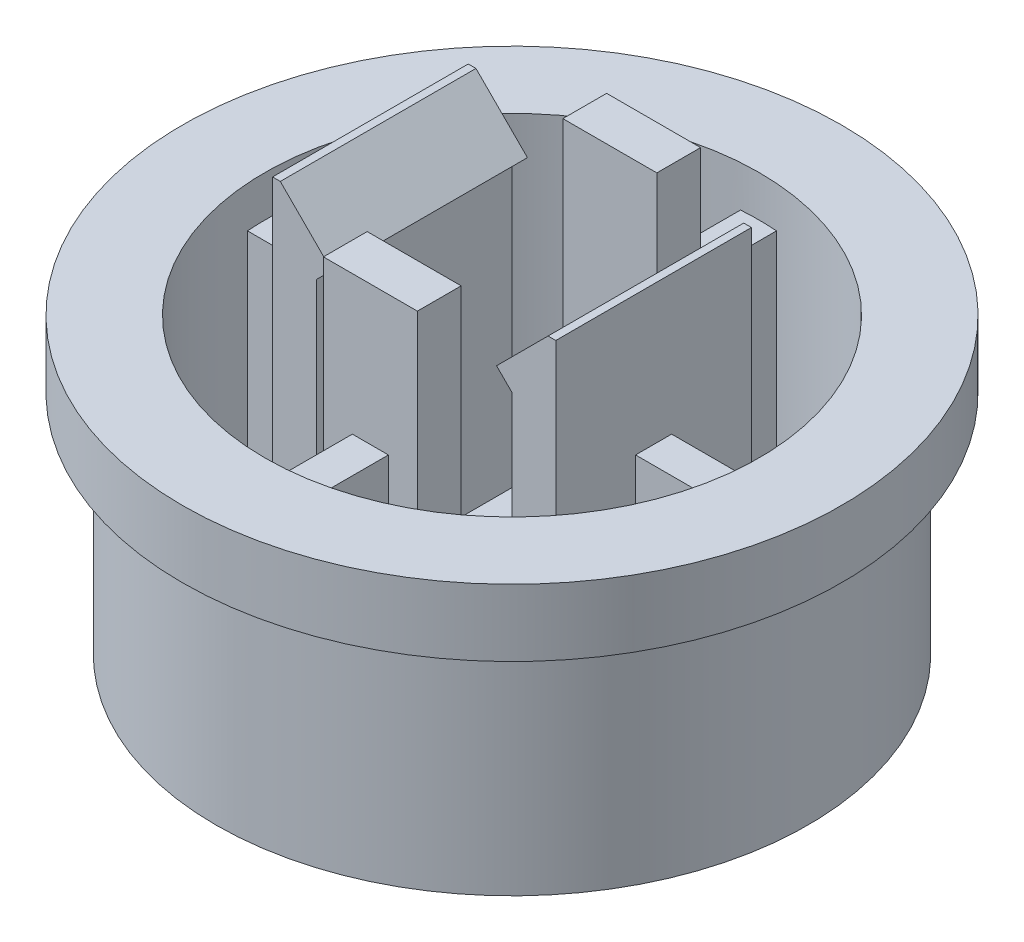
ISO-10303-21;
HEADER;
FILE_DESCRIPTION(('STEP AP214'),'2;1');
FILE_NAME('part.step','',(''),(''),'','','');
FILE_SCHEMA(('AUTOMOTIVE_DESIGN { 1 0 10303 214 1 1 1 1 }'));
ENDSEC;
DATA;
#1=APPLICATION_CONTEXT('core data for automotive mechanical design processes');
#2=APPLICATION_PROTOCOL_DEFINITION('international standard','automotive_design',2000,#1);
#3=PRODUCT_CONTEXT('',#1,'mechanical');
#4=PRODUCT('Part','Part','',(#3));
#5=PRODUCT_RELATED_PRODUCT_CATEGORY('part','',(#4));
#6=PRODUCT_DEFINITION_FORMATION('','',#4);
#7=PRODUCT_DEFINITION_CONTEXT('part definition',#1,'design');
#8=PRODUCT_DEFINITION('design','',#6,#7);
#9=PRODUCT_DEFINITION_SHAPE('','',#8);
#10=(LENGTH_UNIT() NAMED_UNIT(*) SI_UNIT(.MILLI.,.METRE.));
#11=(NAMED_UNIT(*) PLANE_ANGLE_UNIT() SI_UNIT($,.RADIAN.));
#12=(NAMED_UNIT(*) SI_UNIT($,.STERADIAN.) SOLID_ANGLE_UNIT());
#13=UNCERTAINTY_MEASURE_WITH_UNIT(LENGTH_MEASURE(1.E-05),#10,'distance_accuracy_value','');
#14=(GEOMETRIC_REPRESENTATION_CONTEXT(3) GLOBAL_UNCERTAINTY_ASSIGNED_CONTEXT((#13)) GLOBAL_UNIT_ASSIGNED_CONTEXT((#10,
#11,#12)) REPRESENTATION_CONTEXT('',''));
#15=CARTESIAN_POINT('',(0.,0.,0.));
#16=DIRECTION('',(0.,0.,1.));
#17=DIRECTION('',(1.,0.,0.));
#18=AXIS2_PLACEMENT_3D('',#15,#16,#17);
#19=CARTESIAN_POINT('',(0.,0.9,0.));
#20=DIRECTION('',(0.,1.,0.));
#21=DIRECTION('',(0.,0.,1.));
#22=AXIS2_PLACEMENT_3D('',#19,#20,#21);
#23=PLANE('',#22);
#24=DIRECTION('',(1.,0.,0.));
#25=VECTOR('',#24,1.);
#26=CARTESIAN_POINT('',(-0.912441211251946,0.9,2.75));
#27=LINE('',#26,#25);
#28=CARTESIAN_POINT('',(0.35,0.9,2.75));
#29=VERTEX_POINT('',#28);
#30=CARTESIAN_POINT('',(0.912441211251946,0.9,2.75));
#31=VERTEX_POINT('',#30);
#32=EDGE_CURVE('E477',#29,#31,#27,.T.);
#33=ORIENTED_EDGE('',*,*,#32,.F.);
#34=DIRECTION('',(0.,0.,-1.));
#35=VECTOR('',#34,1.);
#36=CARTESIAN_POINT('',(0.35,0.9,4.78722257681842));
#37=LINE('',#36,#35);
#38=CARTESIAN_POINT('',(0.35,0.9,4.78722257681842));
#39=VERTEX_POINT('',#38);
#40=EDGE_CURVE('E669',#39,#29,#37,.T.);
#41=ORIENTED_EDGE('',*,*,#40,.F.);
#42=CARTESIAN_POINT('',(0.,0.900000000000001,0.));
#43=DIRECTION('',(0.,1.,0.));
#44=DIRECTION('',(0.,0.,1.));
#45=AXIS2_PLACEMENT_3D('',#42,#43,#44);
#46=CIRCLE('',#45,4.8);
#47=CARTESIAN_POINT('',(4.78722257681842,0.9,0.349999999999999));
#48=VERTEX_POINT('',#47);
#49=EDGE_CURVE('E295',#48,#39,#46,.F.);
#50=ORIENTED_EDGE('',*,*,#49,.F.);
#51=DIRECTION('',(1.,0.,0.));
#52=VECTOR('',#51,1.);
#53=CARTESIAN_POINT('',(4.78722257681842,0.9,0.349999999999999));
#54=LINE('',#53,#52);
#55=CARTESIAN_POINT('',(2.75,0.9,0.35));
#56=VERTEX_POINT('',#55);
#57=EDGE_CURVE('E301',#56,#48,#54,.T.);
#58=ORIENTED_EDGE('',*,*,#57,.F.);
#59=DIRECTION('',(0.,0.,-1.));
#60=VECTOR('',#59,1.);
#61=CARTESIAN_POINT('',(2.75,0.9,1.9));
#62=LINE('',#61,#60);
#63=CARTESIAN_POINT('',(2.75,0.9,1.9));
#64=VERTEX_POINT('',#63);
#65=EDGE_CURVE('E583',#64,#56,#62,.T.);
#66=ORIENTED_EDGE('',*,*,#65,.F.);
#67=DIRECTION('',(1.,0.,0.));
#68=VECTOR('',#67,1.);
#69=CARTESIAN_POINT('',(1.9,0.9,1.9));
#70=LINE('',#69,#68);
#71=CARTESIAN_POINT('',(1.9,0.9,1.9));
#72=VERTEX_POINT('',#71);
#73=EDGE_CURVE('E597',#72,#64,#70,.T.);
#74=ORIENTED_EDGE('',*,*,#73,.F.);
#75=DIRECTION('',(0.,0.,1.));
#76=VECTOR('',#75,1.);
#77=CARTESIAN_POINT('',(1.9,0.9,1.9));
#78=LINE('',#77,#76);
#79=CARTESIAN_POINT('',(1.9,0.9,-1.9));
#80=VERTEX_POINT('',#79);
#81=EDGE_CURVE('E593',#80,#72,#78,.T.);
#82=ORIENTED_EDGE('',*,*,#81,.F.);
#83=DIRECTION('',(-1.,0.,0.));
#84=VECTOR('',#83,1.);
#85=CARTESIAN_POINT('',(1.9,0.9,-1.9));
#86=LINE('',#85,#84);
#87=CARTESIAN_POINT('',(2.75,0.9,-1.9));
#88=VERTEX_POINT('',#87);
#89=EDGE_CURVE('E577',#88,#80,#86,.T.);
#90=ORIENTED_EDGE('',*,*,#89,.F.);
#91=CARTESIAN_POINT('',(2.75,0.9,-0.35));
#92=VERTEX_POINT('',#91);
#93=EDGE_CURVE('E601',#92,#88,#62,.T.);
#94=ORIENTED_EDGE('',*,*,#93,.F.);
#95=DIRECTION('',(-1.,0.,0.));
#96=VECTOR('',#95,1.);
#97=CARTESIAN_POINT('',(4.78722257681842,0.9,-0.350000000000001));
#98=LINE('',#97,#96);
#99=CARTESIAN_POINT('',(4.78722257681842,0.9,-0.350000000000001));
#100=VERTEX_POINT('',#99);
#101=EDGE_CURVE('E297',#100,#92,#98,.T.);
#102=ORIENTED_EDGE('',*,*,#101,.F.);
#103=CARTESIAN_POINT('',(0.35,0.9,-4.78722257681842));
#104=VERTEX_POINT('',#103);
#105=EDGE_CURVE('E46',#104,#100,#46,.F.);
#106=ORIENTED_EDGE('',*,*,#105,.F.);
#107=DIRECTION('',(0.,0.,-1.));
#108=VECTOR('',#107,1.);
#109=CARTESIAN_POINT('',(0.35,0.9,-2.75));
#110=LINE('',#109,#108);
#111=CARTESIAN_POINT('',(0.35,0.9,-2.75));
#112=VERTEX_POINT('',#111);
#113=EDGE_CURVE('E340',#112,#104,#110,.T.);
#114=ORIENTED_EDGE('',*,*,#113,.F.);
#115=DIRECTION('',(-1.,0.,0.));
#116=VECTOR('',#115,1.);
#117=CARTESIAN_POINT('',(-0.912441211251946,0.9,-2.75));
#118=LINE('',#117,#116);
#119=CARTESIAN_POINT('',(0.912441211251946,0.9,-2.75));
#120=VERTEX_POINT('',#119);
#121=EDGE_CURVE('E514',#120,#112,#118,.T.);
#122=ORIENTED_EDGE('',*,*,#121,.F.);
#123=DIRECTION('',(0.,0.,-1.));
#124=VECTOR('',#123,1.);
#125=CARTESIAN_POINT('',(0.912441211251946,0.9,-1.9));
#126=LINE('',#125,#124);
#127=CARTESIAN_POINT('',(0.912441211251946,0.9,-1.9));
#128=VERTEX_POINT('',#127);
#129=EDGE_CURVE('E494',#128,#120,#126,.T.);
#130=ORIENTED_EDGE('',*,*,#129,.F.);
#131=DIRECTION('',(1.,0.,0.));
#132=VECTOR('',#131,1.);
#133=CARTESIAN_POINT('',(-0.912441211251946,0.9,-1.9));
#134=LINE('',#133,#132);
#135=CARTESIAN_POINT('',(-0.912441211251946,0.9,-1.9));
#136=VERTEX_POINT('',#135);
#137=EDGE_CURVE('E500',#136,#128,#134,.T.);
#138=ORIENTED_EDGE('',*,*,#137,.F.);
#139=DIRECTION('',(0.,0.,1.));
#140=VECTOR('',#139,1.);
#141=CARTESIAN_POINT('',(-0.912441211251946,0.9,-1.9));
#142=LINE('',#141,#140);
#143=CARTESIAN_POINT('',(-0.912441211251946,0.9,-2.75));
#144=VERTEX_POINT('',#143);
#145=EDGE_CURVE('E518',#144,#136,#142,.T.);
#146=ORIENTED_EDGE('',*,*,#145,.F.);
#147=CARTESIAN_POINT('',(-0.35,0.9,-2.75));
#148=VERTEX_POINT('',#147);
#149=EDGE_CURVE('E513',#148,#144,#118,.T.);
#150=ORIENTED_EDGE('',*,*,#149,.F.);
#151=DIRECTION('',(0.,0.,1.));
#152=VECTOR('',#151,1.);
#153=CARTESIAN_POINT('',(-0.35,0.9,-2.75));
#154=LINE('',#153,#152);
#155=CARTESIAN_POINT('',(-0.35,0.9,-4.78722257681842));
#156=VERTEX_POINT('',#155);
#157=EDGE_CURVE('E334',#156,#148,#154,.T.);
#158=ORIENTED_EDGE('',*,*,#157,.F.);
#159=CARTESIAN_POINT('',(-4.78722257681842,0.9,-0.35));
#160=VERTEX_POINT('',#159);
#161=EDGE_CURVE('E11',#160,#156,#46,.F.);
#162=ORIENTED_EDGE('',*,*,#161,.F.);
#163=DIRECTION('',(-1.,0.,0.));
#164=VECTOR('',#163,1.);
#165=CARTESIAN_POINT('',(-2.75,0.9,-0.35));
#166=LINE('',#165,#164);
#167=CARTESIAN_POINT('',(-2.75,0.9,-0.35));
#168=VERTEX_POINT('',#167);
#169=EDGE_CURVE('E374',#168,#160,#166,.T.);
#170=ORIENTED_EDGE('',*,*,#169,.F.);
#171=DIRECTION('',(0.,0.,1.));
#172=VECTOR('',#171,1.);
#173=CARTESIAN_POINT('',(-2.75,0.9,1.9));
#174=LINE('',#173,#172);
#175=CARTESIAN_POINT('',(-2.75,0.9,-1.9));
#176=VERTEX_POINT('',#175);
#177=EDGE_CURVE('E543',#176,#168,#174,.T.);
#178=ORIENTED_EDGE('',*,*,#177,.F.);
#179=DIRECTION('',(-1.,0.,0.));
#180=VECTOR('',#179,1.);
#181=CARTESIAN_POINT('',(-1.9,0.9,-1.9));
#182=LINE('',#181,#180);
#183=CARTESIAN_POINT('',(-1.9,0.9,-1.9));
#184=VERTEX_POINT('',#183);
#185=EDGE_CURVE('E557',#184,#176,#182,.T.);
#186=ORIENTED_EDGE('',*,*,#185,.F.);
#187=DIRECTION('',(0.,0.,-1.));
#188=VECTOR('',#187,1.);
#189=CARTESIAN_POINT('',(-1.9,0.9,1.9));
#190=LINE('',#189,#188);
#191=CARTESIAN_POINT('',(-1.9,0.9,1.9));
#192=VERTEX_POINT('',#191);
#193=EDGE_CURVE('E553',#192,#184,#190,.T.);
#194=ORIENTED_EDGE('',*,*,#193,.F.);
#195=DIRECTION('',(1.,0.,0.));
#196=VECTOR('',#195,1.);
#197=CARTESIAN_POINT('',(-1.9,0.9,1.9));
#198=LINE('',#197,#196);
#199=CARTESIAN_POINT('',(-2.75,0.9,1.9));
#200=VERTEX_POINT('',#199);
#201=EDGE_CURVE('E537',#200,#192,#198,.T.);
#202=ORIENTED_EDGE('',*,*,#201,.F.);
#203=CARTESIAN_POINT('',(-2.75,0.9,0.35));
#204=VERTEX_POINT('',#203);
#205=EDGE_CURVE('E561',#204,#200,#174,.T.);
#206=ORIENTED_EDGE('',*,*,#205,.F.);
#207=DIRECTION('',(1.,0.,0.));
#208=VECTOR('',#207,1.);
#209=CARTESIAN_POINT('',(-2.75,0.9,0.35));
#210=LINE('',#209,#208);
#211=CARTESIAN_POINT('',(-4.78722257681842,0.9,0.35));
#212=VERTEX_POINT('',#211);
#213=EDGE_CURVE('E368',#212,#204,#210,.T.);
#214=ORIENTED_EDGE('',*,*,#213,.F.);
#215=CARTESIAN_POINT('',(-0.35,0.9,4.78722257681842));
#216=VERTEX_POINT('',#215);
#217=EDGE_CURVE('E47',#216,#212,#46,.F.);
#218=ORIENTED_EDGE('',*,*,#217,.F.);
#219=DIRECTION('',(0.,0.,1.));
#220=VECTOR('',#219,1.);
#221=CARTESIAN_POINT('',(-0.35,0.9,4.78722257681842));
#222=LINE('',#221,#220);
#223=CARTESIAN_POINT('',(-0.35,0.9,2.75));
#224=VERTEX_POINT('',#223);
#225=EDGE_CURVE('E289',#224,#216,#222,.T.);
#226=ORIENTED_EDGE('',*,*,#225,.F.);
#227=CARTESIAN_POINT('',(-0.912441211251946,0.9,2.75));
#228=VERTEX_POINT('',#227);
#229=EDGE_CURVE('E457',#228,#224,#27,.T.);
#230=ORIENTED_EDGE('',*,*,#229,.F.);
#231=DIRECTION('',(0.,0.,1.));
#232=VECTOR('',#231,1.);
#233=CARTESIAN_POINT('',(-0.912441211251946,0.9,2.75));
#234=LINE('',#233,#232);
#235=CARTESIAN_POINT('',(-0.912441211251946,0.9,1.9));
#236=VERTEX_POINT('',#235);
#237=EDGE_CURVE('E473',#236,#228,#234,.T.);
#238=ORIENTED_EDGE('',*,*,#237,.F.);
#239=DIRECTION('',(-1.,0.,0.));
#240=VECTOR('',#239,1.);
#241=CARTESIAN_POINT('',(-0.912441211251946,0.9,1.9));
#242=LINE('',#241,#240);
#243=CARTESIAN_POINT('',(0.912441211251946,0.9,1.9));
#244=VERTEX_POINT('',#243);
#245=EDGE_CURVE('E470',#244,#236,#242,.T.);
#246=ORIENTED_EDGE('',*,*,#245,.F.);
#247=DIRECTION('',(0.,0.,-1.));
#248=VECTOR('',#247,1.);
#249=CARTESIAN_POINT('',(0.912441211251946,0.9,2.75));
#250=LINE('',#249,#248);
#251=EDGE_CURVE('E448',#31,#244,#250,.T.);
#252=ORIENTED_EDGE('',*,*,#251,.F.);
#253=EDGE_LOOP('',(#33,#41,#50,#58,#66,#74,#82,#90,#94,#102,#106,#114,#122,#130,#138,#146,#150,
#158,#162,#170,#178,#186,#194,#202,#206,#214,#218,#226,#230,#238,#246,#252));
#254=FACE_BOUND('',#253,.T.);
#255=ADVANCED_FACE('F37',(#254),#23,.T.);
#256=CARTESIAN_POINT('',(0.,4.4,0.));
#257=DIRECTION('',(0.,-1.,0.));
#258=DIRECTION('',(0.,0.,-1.));
#259=AXIS2_PLACEMENT_3D('',#256,#257,#258);
#260=CYLINDRICAL_SURFACE('',#259,4.8);
#261=CARTESIAN_POINT('',(0.,5.7,0.));
#262=DIRECTION('',(0.,1.,0.));
#263=DIRECTION('',(0.,0.,1.));
#264=AXIS2_PLACEMENT_3D('',#261,#262,#263);
#265=CIRCLE('',#264,4.8);
#266=CARTESIAN_POINT('',(0.,5.7,4.8));
#267=VERTEX_POINT('',#266);
#268=EDGE_CURVE('E617',#267,#267,#265,.T.);
#269=ORIENTED_EDGE('',*,*,#268,.T.);
#270=EDGE_LOOP('',(#269));
#271=FACE_BOUND('',#270,.T.);
#272=ORIENTED_EDGE('',*,*,#49,.T.);
#273=DIRECTION('',(0.,-1.,0.));
#274=VECTOR('',#273,1.);
#275=CARTESIAN_POINT('',(0.35,4.9,4.78722257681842));
#276=LINE('',#275,#274);
#277=CARTESIAN_POINT('',(0.35,4.9,4.78722257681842));
#278=VERTEX_POINT('',#277);
#279=EDGE_CURVE('E273',#278,#39,#276,.T.);
#280=ORIENTED_EDGE('',*,*,#279,.F.);
#281=CARTESIAN_POINT('',(0.,4.9,0.));
#282=DIRECTION('',(0.,1.,0.));
#283=DIRECTION('',(0.,0.,1.));
#284=AXIS2_PLACEMENT_3D('',#281,#282,#283);
#285=CIRCLE('',#284,4.8);
#286=CARTESIAN_POINT('',(-0.35,4.9,4.78722257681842));
#287=VERTEX_POINT('',#286);
#288=EDGE_CURVE('E279',#287,#278,#285,.T.);
#289=ORIENTED_EDGE('',*,*,#288,.F.);
#290=DIRECTION('',(0.,-1.,0.));
#291=VECTOR('',#290,1.);
#292=CARTESIAN_POINT('',(-0.35,4.9,4.78722257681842));
#293=LINE('',#292,#291);
#294=EDGE_CURVE('E679',#287,#216,#293,.T.);
#295=ORIENTED_EDGE('',*,*,#294,.T.);
#296=ORIENTED_EDGE('',*,*,#217,.T.);
#297=DIRECTION('',(0.,-1.,0.));
#298=VECTOR('',#297,1.);
#299=CARTESIAN_POINT('',(-4.78722257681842,4.9,0.35));
#300=LINE('',#299,#298);
#301=CARTESIAN_POINT('',(-4.78722257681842,4.9,0.35));
#302=VERTEX_POINT('',#301);
#303=EDGE_CURVE('E398',#302,#212,#300,.T.);
#304=ORIENTED_EDGE('',*,*,#303,.F.);
#305=CARTESIAN_POINT('',(0.,4.9,0.));
#306=DIRECTION('',(0.,1.,0.));
#307=DIRECTION('',(0.,0.,1.));
#308=AXIS2_PLACEMENT_3D('',#305,#306,#307);
#309=CIRCLE('',#308,4.8);
#310=CARTESIAN_POINT('',(-4.78722257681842,4.9,-0.35));
#311=VERTEX_POINT('',#310);
#312=EDGE_CURVE('E369',#311,#302,#309,.T.);
#313=ORIENTED_EDGE('',*,*,#312,.F.);
#314=DIRECTION('',(0.,-1.,0.));
#315=VECTOR('',#314,1.);
#316=CARTESIAN_POINT('',(-4.78722257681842,4.9,-0.35));
#317=LINE('',#316,#315);
#318=EDGE_CURVE('E383',#311,#160,#317,.T.);
#319=ORIENTED_EDGE('',*,*,#318,.T.);
#320=ORIENTED_EDGE('',*,*,#161,.T.);
#321=DIRECTION('',(0.,-1.,0.));
#322=VECTOR('',#321,1.);
#323=CARTESIAN_POINT('',(-0.35,4.9,-4.78722257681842));
#324=LINE('',#323,#322);
#325=CARTESIAN_POINT('',(-0.35,4.9,-4.78722257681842));
#326=VERTEX_POINT('',#325);
#327=EDGE_CURVE('E365',#326,#156,#324,.T.);
#328=ORIENTED_EDGE('',*,*,#327,.F.);
#329=CARTESIAN_POINT('',(0.,4.9,0.));
#330=DIRECTION('',(0.,1.,0.));
#331=DIRECTION('',(0.,0.,1.));
#332=AXIS2_PLACEMENT_3D('',#329,#330,#331);
#333=CIRCLE('',#332,4.8);
#334=CARTESIAN_POINT('',(0.35,4.9,-4.78722257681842));
#335=VERTEX_POINT('',#334);
#336=EDGE_CURVE('E335',#335,#326,#333,.T.);
#337=ORIENTED_EDGE('',*,*,#336,.F.);
#338=DIRECTION('',(0.,-1.,0.));
#339=VECTOR('',#338,1.);
#340=CARTESIAN_POINT('',(0.35,4.9,-4.78722257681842));
#341=LINE('',#340,#339);
#342=EDGE_CURVE('E350',#335,#104,#341,.T.);
#343=ORIENTED_EDGE('',*,*,#342,.T.);
#344=ORIENTED_EDGE('',*,*,#105,.T.);
#345=DIRECTION('',(0.,-1.,0.));
#346=VECTOR('',#345,1.);
#347=CARTESIAN_POINT('',(4.78722257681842,4.9,-0.350000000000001));
#348=LINE('',#347,#346);
#349=CARTESIAN_POINT('',(4.78722257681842,4.9,-0.350000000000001));
#350=VERTEX_POINT('',#349);
#351=EDGE_CURVE('E331',#350,#100,#348,.T.);
#352=ORIENTED_EDGE('',*,*,#351,.F.);
#353=CARTESIAN_POINT('',(0.,4.9,0.));
#354=DIRECTION('',(0.,1.,0.));
#355=DIRECTION('',(0.,0.,1.));
#356=AXIS2_PLACEMENT_3D('',#353,#354,#355);
#357=CIRCLE('',#356,4.8);
#358=CARTESIAN_POINT('',(4.78722257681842,4.9,0.349999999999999));
#359=VERTEX_POINT('',#358);
#360=EDGE_CURVE('E308',#359,#350,#357,.T.);
#361=ORIENTED_EDGE('',*,*,#360,.F.);
#362=DIRECTION('',(0.,-1.,0.));
#363=VECTOR('',#362,1.);
#364=CARTESIAN_POINT('',(4.78722257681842,4.9,0.349999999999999));
#365=LINE('',#364,#363);
#366=EDGE_CURVE('E320',#359,#48,#365,.T.);
#367=ORIENTED_EDGE('',*,*,#366,.T.);
#368=EDGE_LOOP('',(#272,#280,#289,#295,#296,#304,#313,#319,#320,#328,#337,#343,#344,#352,#361,#367));
#369=FACE_BOUND('',#368,.T.);
#370=ADVANCED_FACE('F292',(#271,#369),#260,.F.);
#371=CARTESIAN_POINT('',(-0.912441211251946,7.6,2.75));
#372=DIRECTION('',(0.,0.,-1.));
#373=DIRECTION('',(-1.,0.,0.));
#374=AXIS2_PLACEMENT_3D('',#371,#372,#373);
#375=PLANE('',#374);
#376=DIRECTION('',(0.,-1.,0.));
#377=VECTOR('',#376,1.);
#378=CARTESIAN_POINT('',(0.35,4.9,2.75));
#379=LINE('',#378,#377);
#380=CARTESIAN_POINT('',(0.35,4.9,2.75));
#381=VERTEX_POINT('',#380);
#382=EDGE_CURVE('E54',#381,#29,#379,.T.);
#383=ORIENTED_EDGE('',*,*,#382,.T.);
#384=ORIENTED_EDGE('',*,*,#32,.T.);
#385=DIRECTION('',(0.,-1.,0.));
#386=VECTOR('',#385,1.);
#387=CARTESIAN_POINT('',(0.912441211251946,7.6,2.75));
#388=LINE('',#387,#386);
#389=CARTESIAN_POINT('',(0.912441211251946,7.6,2.75));
#390=VERTEX_POINT('',#389);
#391=EDGE_CURVE('E466',#390,#31,#388,.T.);
#392=ORIENTED_EDGE('',*,*,#391,.F.);
#393=DIRECTION('',(1.,0.,0.));
#394=VECTOR('',#393,1.);
#395=CARTESIAN_POINT('',(-0.912441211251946,7.6,2.75));
#396=LINE('',#395,#394);
#397=CARTESIAN_POINT('',(-0.912441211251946,7.6,2.75));
#398=VERTEX_POINT('',#397);
#399=EDGE_CURVE('E463',#398,#390,#396,.T.);
#400=ORIENTED_EDGE('',*,*,#399,.F.);
#401=DIRECTION('',(0.,-1.,0.));
#402=VECTOR('',#401,1.);
#403=CARTESIAN_POINT('',(-0.912441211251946,7.6,2.75));
#404=LINE('',#403,#402);
#405=EDGE_CURVE('E484',#398,#228,#404,.T.);
#406=ORIENTED_EDGE('',*,*,#405,.T.);
#407=ORIENTED_EDGE('',*,*,#229,.T.);
#408=DIRECTION('',(0.,-1.,0.));
#409=VECTOR('',#408,1.);
#410=CARTESIAN_POINT('',(-0.35,4.9,2.75));
#411=LINE('',#410,#409);
#412=CARTESIAN_POINT('',(-0.35,4.9,2.75));
#413=VERTEX_POINT('',#412);
#414=EDGE_CURVE('E304',#413,#224,#411,.T.);
#415=ORIENTED_EDGE('',*,*,#414,.F.);
#416=DIRECTION('',(-1.,0.,0.));
#417=VECTOR('',#416,1.);
#418=CARTESIAN_POINT('',(-0.35,4.9,2.75));
#419=LINE('',#418,#417);
#420=EDGE_CURVE('E278',#381,#413,#419,.T.);
#421=ORIENTED_EDGE('',*,*,#420,.F.);
#422=EDGE_LOOP('',(#383,#384,#392,#400,#406,#407,#415,#421));
#423=FACE_BOUND('',#422,.T.);
#424=ADVANCED_FACE('F691',(#423),#375,.F.);
#425=CARTESIAN_POINT('',(2.75,7.6,1.9));
#426=DIRECTION('',(-1.,0.,0.));
#427=DIRECTION('',(0.,0.,1.));
#428=AXIS2_PLACEMENT_3D('',#425,#426,#427);
#429=PLANE('',#428);
#430=DIRECTION('',(0.,-1.,0.));
#431=VECTOR('',#430,1.);
#432=CARTESIAN_POINT('',(2.75,4.9,-0.35));
#433=LINE('',#432,#431);
#434=CARTESIAN_POINT('',(2.75,4.9,-0.350000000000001));
#435=VERTEX_POINT('',#434);
#436=EDGE_CURVE('E62',#435,#92,#433,.T.);
#437=ORIENTED_EDGE('',*,*,#436,.T.);
#438=ORIENTED_EDGE('',*,*,#93,.T.);
#439=DIRECTION('',(0.,-1.,0.));
#440=VECTOR('',#439,1.);
#441=CARTESIAN_POINT('',(2.75,7.6,-1.9));
#442=LINE('',#441,#440);
#443=CARTESIAN_POINT('',(2.75,7.6,-1.9));
#444=VERTEX_POINT('',#443);
#445=EDGE_CURVE('E589',#444,#88,#442,.T.);
#446=ORIENTED_EDGE('',*,*,#445,.F.);
#447=DIRECTION('',(0.,0.,-1.));
#448=VECTOR('',#447,1.);
#449=CARTESIAN_POINT('',(2.75,7.6,1.9));
#450=LINE('',#449,#448);
#451=CARTESIAN_POINT('',(2.75,7.6,1.9));
#452=VERTEX_POINT('',#451);
#453=EDGE_CURVE('E586',#452,#444,#450,.T.);
#454=ORIENTED_EDGE('',*,*,#453,.F.);
#455=DIRECTION('',(0.,-1.,0.));
#456=VECTOR('',#455,1.);
#457=CARTESIAN_POINT('',(2.75,7.6,1.9));
#458=LINE('',#457,#456);
#459=EDGE_CURVE('E608',#452,#64,#458,.T.);
#460=ORIENTED_EDGE('',*,*,#459,.T.);
#461=ORIENTED_EDGE('',*,*,#65,.T.);
#462=DIRECTION('',(0.,-1.,0.));
#463=VECTOR('',#462,1.);
#464=CARTESIAN_POINT('',(2.75,4.9,0.35));
#465=LINE('',#464,#463);
#466=CARTESIAN_POINT('',(2.75,4.9,0.35));
#467=VERTEX_POINT('',#466);
#468=EDGE_CURVE('E326',#467,#56,#465,.T.);
#469=ORIENTED_EDGE('',*,*,#468,.F.);
#470=DIRECTION('',(0.,0.,1.));
#471=VECTOR('',#470,1.);
#472=CARTESIAN_POINT('',(2.75,4.9,0.35));
#473=LINE('',#472,#471);
#474=EDGE_CURVE('E315',#435,#467,#473,.T.);
#475=ORIENTED_EDGE('',*,*,#474,.F.);
#476=EDGE_LOOP('',(#437,#438,#446,#454,#460,#461,#469,#475));
#477=FACE_BOUND('',#476,.T.);
#478=ADVANCED_FACE('F658',(#477),#429,.F.);
#479=CARTESIAN_POINT('',(-0.912441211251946,7.6,-2.75));
#480=DIRECTION('',(0.,0.,1.));
#481=DIRECTION('',(1.,0.,0.));
#482=AXIS2_PLACEMENT_3D('',#479,#480,#481);
#483=PLANE('',#482);
#484=DIRECTION('',(0.,-1.,0.));
#485=VECTOR('',#484,1.);
#486=CARTESIAN_POINT('',(-0.35,4.9,-2.75));
#487=LINE('',#486,#485);
#488=CARTESIAN_POINT('',(-0.35,4.9,-2.75));
#489=VERTEX_POINT('',#488);
#490=EDGE_CURVE('E361',#489,#148,#487,.T.);
#491=ORIENTED_EDGE('',*,*,#490,.T.);
#492=ORIENTED_EDGE('',*,*,#149,.T.);
#493=DIRECTION('',(0.,-1.,0.));
#494=VECTOR('',#493,1.);
#495=CARTESIAN_POINT('',(-0.912441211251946,7.6,-2.75));
#496=LINE('',#495,#494);
#497=CARTESIAN_POINT('',(-0.912441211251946,7.6,-2.75));
#498=VERTEX_POINT('',#497);
#499=EDGE_CURVE('E530',#498,#144,#496,.T.);
#500=ORIENTED_EDGE('',*,*,#499,.F.);
#501=DIRECTION('',(-1.,0.,0.));
#502=VECTOR('',#501,1.);
#503=CARTESIAN_POINT('',(-0.912441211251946,7.6,-2.75));
#504=LINE('',#503,#502);
#505=CARTESIAN_POINT('',(0.912441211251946,7.6,-2.75));
#506=VERTEX_POINT('',#505);
#507=EDGE_CURVE('E499',#506,#498,#504,.T.);
#508=ORIENTED_EDGE('',*,*,#507,.F.);
#509=DIRECTION('',(0.,-1.,0.));
#510=VECTOR('',#509,1.);
#511=CARTESIAN_POINT('',(0.912441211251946,7.6,-2.75));
#512=LINE('',#511,#510);
#513=EDGE_CURVE('E534',#506,#120,#512,.T.);
#514=ORIENTED_EDGE('',*,*,#513,.T.);
#515=ORIENTED_EDGE('',*,*,#121,.T.);
#516=DIRECTION('',(0.,-1.,0.));
#517=VECTOR('',#516,1.);
#518=CARTESIAN_POINT('',(0.35,4.9,-2.75));
#519=LINE('',#518,#517);
#520=CARTESIAN_POINT('',(0.35,4.9,-2.75));
#521=VERTEX_POINT('',#520);
#522=EDGE_CURVE('E358',#521,#112,#519,.T.);
#523=ORIENTED_EDGE('',*,*,#522,.F.);
#524=DIRECTION('',(1.,0.,0.));
#525=VECTOR('',#524,1.);
#526=CARTESIAN_POINT('',(-0.35,4.9,-2.75));
#527=LINE('',#526,#525);
#528=EDGE_CURVE('E344',#489,#521,#527,.T.);
#529=ORIENTED_EDGE('',*,*,#528,.F.);
#530=EDGE_LOOP('',(#491,#492,#500,#508,#514,#515,#523,#529));
#531=FACE_BOUND('',#530,.T.);
#532=ADVANCED_FACE('F796',(#531),#483,.F.);
#533=CARTESIAN_POINT('',(-2.75,7.6,1.9));
#534=DIRECTION('',(1.,0.,0.));
#535=DIRECTION('',(0.,0.,-1.));
#536=AXIS2_PLACEMENT_3D('',#533,#534,#535);
#537=PLANE('',#536);
#538=DIRECTION('',(0.,-1.,0.));
#539=VECTOR('',#538,1.);
#540=CARTESIAN_POINT('',(-2.75,4.9,0.35));
#541=LINE('',#540,#539);
#542=CARTESIAN_POINT('',(-2.75,4.9,0.35));
#543=VERTEX_POINT('',#542);
#544=EDGE_CURVE('E394',#543,#204,#541,.T.);
#545=ORIENTED_EDGE('',*,*,#544,.T.);
#546=ORIENTED_EDGE('',*,*,#205,.T.);
#547=DIRECTION('',(0.,-1.,0.));
#548=VECTOR('',#547,1.);
#549=CARTESIAN_POINT('',(-2.75,7.6,1.9));
#550=LINE('',#549,#548);
#551=CARTESIAN_POINT('',(-2.75,7.6,1.9));
#552=VERTEX_POINT('',#551);
#553=EDGE_CURVE('E549',#552,#200,#550,.T.);
#554=ORIENTED_EDGE('',*,*,#553,.F.);
#555=DIRECTION('',(0.,0.,1.));
#556=VECTOR('',#555,1.);
#557=CARTESIAN_POINT('',(-2.75,7.6,1.9));
#558=LINE('',#557,#556);
#559=CARTESIAN_POINT('',(-2.75,7.6,-1.9));
#560=VERTEX_POINT('',#559);
#561=EDGE_CURVE('E546',#560,#552,#558,.T.);
#562=ORIENTED_EDGE('',*,*,#561,.F.);
#563=DIRECTION('',(0.,-1.,0.));
#564=VECTOR('',#563,1.);
#565=CARTESIAN_POINT('',(-2.75,7.6,-1.9));
#566=LINE('',#565,#564);
#567=EDGE_CURVE('E568',#560,#176,#566,.T.);
#568=ORIENTED_EDGE('',*,*,#567,.T.);
#569=ORIENTED_EDGE('',*,*,#177,.T.);
#570=DIRECTION('',(0.,-1.,0.));
#571=VECTOR('',#570,1.);
#572=CARTESIAN_POINT('',(-2.75,4.9,-0.35));
#573=LINE('',#572,#571);
#574=CARTESIAN_POINT('',(-2.75,4.9,-0.35));
#575=VERTEX_POINT('',#574);
#576=EDGE_CURVE('E391',#575,#168,#573,.T.);
#577=ORIENTED_EDGE('',*,*,#576,.F.);
#578=DIRECTION('',(0.,0.,-1.));
#579=VECTOR('',#578,1.);
#580=CARTESIAN_POINT('',(-2.75,4.9,0.35));
#581=LINE('',#580,#579);
#582=EDGE_CURVE('E378',#543,#575,#581,.T.);
#583=ORIENTED_EDGE('',*,*,#582,.F.);
#584=EDGE_LOOP('',(#545,#546,#554,#562,#568,#569,#577,#583));
#585=FACE_BOUND('',#584,.T.);
#586=ADVANCED_FACE('F712',(#585),#537,.F.);
#587=CARTESIAN_POINT('',(-1.9,7.6,1.9));
#588=DIRECTION('',(-1.,0.,0.));
#589=DIRECTION('',(0.,0.,1.));
#590=AXIS2_PLACEMENT_3D('',#587,#588,#589);
#591=PLANE('',#590);
#592=DIRECTION('',(0.,-1.,0.));
#593=VECTOR('',#592,1.);
#594=CARTESIAN_POINT('',(-1.9,7.6,-1.9));
#595=LINE('',#594,#593);
#596=CARTESIAN_POINT('',(-1.9,6.3,-1.9));
#597=VERTEX_POINT('',#596);
#598=EDGE_CURVE('E571',#597,#184,#595,.T.);
#599=ORIENTED_EDGE('',*,*,#598,.F.);
#600=DIRECTION('',(0.,0.,-1.));
#601=VECTOR('',#600,1.);
#602=CARTESIAN_POINT('',(-1.9,6.3,1.9));
#603=LINE('',#602,#601);
#604=CARTESIAN_POINT('',(-1.9,6.3,1.9));
#605=VERTEX_POINT('',#604);
#606=EDGE_CURVE('E444',#605,#597,#603,.T.);
#607=ORIENTED_EDGE('',*,*,#606,.F.);
#608=DIRECTION('',(0.,-1.,0.));
#609=VECTOR('',#608,1.);
#610=CARTESIAN_POINT('',(-1.9,7.6,1.9));
#611=LINE('',#610,#609);
#612=EDGE_CURVE('E574',#605,#192,#611,.T.);
#613=ORIENTED_EDGE('',*,*,#612,.T.);
#614=ORIENTED_EDGE('',*,*,#193,.T.);
#615=EDGE_LOOP('',(#599,#607,#613,#614));
#616=FACE_BOUND('',#615,.T.);
#617=ADVANCED_FACE('F725',(#616),#591,.F.);
#618=CARTESIAN_POINT('',(0.,0.9,0.));
#619=DIRECTION('',(0.,-1.,0.));
#620=DIRECTION('',(0.,0.,-1.));
#621=AXIS2_PLACEMENT_3D('',#618,#619,#620);
#622=CYLINDRICAL_SURFACE('',#621,5.75);
#623=CARTESIAN_POINT('',(0.,0.,0.));
#624=DIRECTION('',(0.,1.,0.));
#625=DIRECTION('',(0.,0.,1.));
#626=AXIS2_PLACEMENT_3D('',#623,#624,#625);
#627=CIRCLE('',#626,5.75);
#628=CARTESIAN_POINT('',(0.,0.,5.75));
#629=VERTEX_POINT('',#628);
#630=EDGE_CURVE('E632',#629,#629,#627,.T.);
#631=ORIENTED_EDGE('',*,*,#630,.T.);
#632=EDGE_LOOP('',(#631));
#633=FACE_BOUND('',#632,.T.);
#634=CARTESIAN_POINT('',(0.,4.4,0.));
#635=DIRECTION('',(0.,1.,0.));
#636=DIRECTION('',(0.,0.,1.));
#637=AXIS2_PLACEMENT_3D('',#634,#635,#636);
#638=CIRCLE('',#637,5.75);
#639=CARTESIAN_POINT('',(0.,4.4,5.75));
#640=VERTEX_POINT('',#639);
#641=EDGE_CURVE('E626',#640,#640,#638,.T.);
#642=ORIENTED_EDGE('',*,*,#641,.F.);
#643=EDGE_LOOP('',(#642));
#644=FACE_BOUND('',#643,.T.);
#645=ADVANCED_FACE('F39',(#633,#644),#622,.T.);
#646=CARTESIAN_POINT('',(0.,0.,0.));
#647=DIRECTION('',(0.,1.,0.));
#648=DIRECTION('',(0.,0.,1.));
#649=AXIS2_PLACEMENT_3D('',#646,#647,#648);
#650=PLANE('',#649);
#651=ORIENTED_EDGE('',*,*,#630,.F.);
#652=EDGE_LOOP('',(#651));
#653=FACE_BOUND('',#652,.T.);
#654=ADVANCED_FACE('F775',(#653),#650,.F.);
#655=CARTESIAN_POINT('',(0.,4.4,0.));
#656=DIRECTION('',(0.,1.,0.));
#657=DIRECTION('',(0.,0.,1.));
#658=AXIS2_PLACEMENT_3D('',#655,#656,#657);
#659=PLANE('',#658);
#660=CARTESIAN_POINT('',(0.,4.4,0.));
#661=DIRECTION('',(0.,1.,0.));
#662=DIRECTION('',(0.,0.,1.));
#663=AXIS2_PLACEMENT_3D('',#660,#661,#662);
#664=CIRCLE('',#663,6.4);
#665=CARTESIAN_POINT('',(0.,4.4,6.4));
#666=VERTEX_POINT('',#665);
#667=EDGE_CURVE('E621',#666,#666,#664,.T.);
#668=ORIENTED_EDGE('',*,*,#667,.F.);
#669=EDGE_LOOP('',(#668));
#670=FACE_BOUND('',#669,.T.);
#671=ORIENTED_EDGE('',*,*,#641,.T.);
#672=EDGE_LOOP('',(#671));
#673=FACE_BOUND('',#672,.T.);
#674=ADVANCED_FACE('F777',(#670,#673),#659,.F.);
#675=CARTESIAN_POINT('',(0.,5.7,0.));
#676=DIRECTION('',(0.,1.,0.));
#677=DIRECTION('',(0.,0.,1.));
#678=AXIS2_PLACEMENT_3D('',#675,#676,#677);
#679=PLANE('',#678);
#680=CARTESIAN_POINT('',(0.,5.7,0.));
#681=DIRECTION('',(0.,1.,0.));
#682=DIRECTION('',(0.,0.,1.));
#683=AXIS2_PLACEMENT_3D('',#680,#681,#682);
#684=CIRCLE('',#683,6.4);
#685=CARTESIAN_POINT('',(0.,5.7,6.4));
#686=VERTEX_POINT('',#685);
#687=EDGE_CURVE('E622',#686,#686,#684,.T.);
#688=ORIENTED_EDGE('',*,*,#687,.T.);
#689=EDGE_LOOP('',(#688));
#690=FACE_BOUND('',#689,.T.);
#691=ORIENTED_EDGE('',*,*,#268,.F.);
#692=EDGE_LOOP('',(#691));
#693=FACE_BOUND('',#692,.T.);
#694=ADVANCED_FACE('F783',(#690,#693),#679,.T.);
#695=CARTESIAN_POINT('',(0.,5.7,0.));
#696=DIRECTION('',(0.,-1.,0.));
#697=DIRECTION('',(0.,0.,-1.));
#698=AXIS2_PLACEMENT_3D('',#695,#696,#697);
#699=CYLINDRICAL_SURFACE('',#698,6.4);
#700=ORIENTED_EDGE('',*,*,#687,.F.);
#701=EDGE_LOOP('',(#700));
#702=FACE_BOUND('',#701,.T.);
#703=ORIENTED_EDGE('',*,*,#667,.T.);
#704=EDGE_LOOP('',(#703));
#705=FACE_BOUND('',#704,.T.);
#706=ADVANCED_FACE('F819',(#702,#705),#699,.T.);
#707=CARTESIAN_POINT('',(1.9,7.6,-1.9));
#708=DIRECTION('',(0.,0.,1.));
#709=DIRECTION('',(1.,0.,0.));
#710=AXIS2_PLACEMENT_3D('',#707,#708,#709);
#711=PLANE('',#710);
#712=DIRECTION('',(0.707106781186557,0.707106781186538,0.));
#713=VECTOR('',#712,1.);
#714=CARTESIAN_POINT('',(1.6,6.60000000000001,-1.9));
#715=LINE('',#714,#713);
#716=CARTESIAN_POINT('',(1.6,6.60000000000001,-1.9));
#717=VERTEX_POINT('',#716);
#718=CARTESIAN_POINT('',(2.60000000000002,7.6,-1.9));
#719=VERTEX_POINT('',#718);
#720=EDGE_CURVE('E416',#717,#719,#715,.T.);
#721=ORIENTED_EDGE('',*,*,#720,.T.);
#722=DIRECTION('',(-1.,0.,0.));
#723=VECTOR('',#722,1.);
#724=CARTESIAN_POINT('',(1.9,7.6,-1.9));
#725=LINE('',#724,#723);
#726=EDGE_CURVE('E578',#444,#719,#725,.T.);
#727=ORIENTED_EDGE('',*,*,#726,.F.);
#728=ORIENTED_EDGE('',*,*,#445,.T.);
#729=ORIENTED_EDGE('',*,*,#89,.T.);
#730=DIRECTION('',(0.,-1.,0.));
#731=VECTOR('',#730,1.);
#732=CARTESIAN_POINT('',(1.9,7.6,-1.9));
#733=LINE('',#732,#731);
#734=CARTESIAN_POINT('',(1.9,6.3,-1.9));
#735=VERTEX_POINT('',#734);
#736=EDGE_CURVE('E614',#735,#80,#733,.T.);
#737=ORIENTED_EDGE('',*,*,#736,.F.);
#738=DIRECTION('',(-0.707106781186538,0.707106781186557,0.));
#739=VECTOR('',#738,1.);
#740=CARTESIAN_POINT('',(1.9,6.3,-1.9));
#741=LINE('',#740,#739);
#742=EDGE_CURVE('E410',#735,#717,#741,.T.);
#743=ORIENTED_EDGE('',*,*,#742,.T.);
#744=EDGE_LOOP('',(#721,#727,#728,#729,#737,#743));
#745=FACE_BOUND('',#744,.T.);
#746=ADVANCED_FACE('F815',(#745),#711,.F.);
#747=CARTESIAN_POINT('',(1.9,7.6,1.9));
#748=DIRECTION('',(1.,0.,0.));
#749=DIRECTION('',(0.,0.,-1.));
#750=AXIS2_PLACEMENT_3D('',#747,#748,#749);
#751=PLANE('',#750);
#752=DIRECTION('',(0.,-1.,0.));
#753=VECTOR('',#752,1.);
#754=CARTESIAN_POINT('',(1.9,7.6,1.9));
#755=LINE('',#754,#753);
#756=CARTESIAN_POINT('',(1.9,6.3,1.9));
#757=VERTEX_POINT('',#756);
#758=EDGE_CURVE('E611',#757,#72,#755,.T.);
#759=ORIENTED_EDGE('',*,*,#758,.F.);
#760=DIRECTION('',(0.,0.,-1.));
#761=VECTOR('',#760,1.);
#762=CARTESIAN_POINT('',(1.9,6.3,1.9));
#763=LINE('',#762,#761);
#764=EDGE_CURVE('E419',#757,#735,#763,.T.);
#765=ORIENTED_EDGE('',*,*,#764,.T.);
#766=ORIENTED_EDGE('',*,*,#736,.T.);
#767=ORIENTED_EDGE('',*,*,#81,.T.);
#768=EDGE_LOOP('',(#759,#765,#766,#767));
#769=FACE_BOUND('',#768,.T.);
#770=ADVANCED_FACE('F811',(#769),#751,.F.);
#771=CARTESIAN_POINT('',(1.9,7.6,1.9));
#772=DIRECTION('',(0.,0.,-1.));
#773=DIRECTION('',(-1.,0.,0.));
#774=AXIS2_PLACEMENT_3D('',#771,#772,#773);
#775=PLANE('',#774);
#776=DIRECTION('',(1.,0.,0.));
#777=VECTOR('',#776,1.);
#778=CARTESIAN_POINT('',(1.9,7.6,1.9));
#779=LINE('',#778,#777);
#780=CARTESIAN_POINT('',(2.60000000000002,7.6,1.9));
#781=VERTEX_POINT('',#780);
#782=EDGE_CURVE('E582',#781,#452,#779,.T.);
#783=ORIENTED_EDGE('',*,*,#782,.F.);
#784=DIRECTION('',(0.707106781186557,0.707106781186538,0.));
#785=VECTOR('',#784,1.);
#786=CARTESIAN_POINT('',(1.6,6.60000000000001,1.9));
#787=LINE('',#786,#785);
#788=CARTESIAN_POINT('',(1.6,6.60000000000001,1.9));
#789=VERTEX_POINT('',#788);
#790=EDGE_CURVE('E415',#789,#781,#787,.T.);
#791=ORIENTED_EDGE('',*,*,#790,.F.);
#792=DIRECTION('',(-0.707106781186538,0.707106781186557,0.));
#793=VECTOR('',#792,1.);
#794=CARTESIAN_POINT('',(1.9,6.3,1.9));
#795=LINE('',#794,#793);
#796=EDGE_CURVE('E411',#757,#789,#795,.T.);
#797=ORIENTED_EDGE('',*,*,#796,.F.);
#798=ORIENTED_EDGE('',*,*,#758,.T.);
#799=ORIENTED_EDGE('',*,*,#73,.T.);
#800=ORIENTED_EDGE('',*,*,#459,.F.);
#801=EDGE_LOOP('',(#783,#791,#797,#798,#799,#800));
#802=FACE_BOUND('',#801,.T.);
#803=ADVANCED_FACE('F805',(#802),#775,.F.);
#804=CARTESIAN_POINT('',(0.,7.6,0.));
#805=DIRECTION('',(0.,1.,0.));
#806=DIRECTION('',(0.,0.,1.));
#807=AXIS2_PLACEMENT_3D('',#804,#805,#806);
#808=PLANE('',#807);
#809=DIRECTION('',(0.,0.,-1.));
#810=VECTOR('',#809,1.);
#811=CARTESIAN_POINT('',(2.60000000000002,7.6,6.401));
#812=LINE('',#811,#810);
#813=EDGE_CURVE('E402',#781,#719,#812,.T.);
#814=ORIENTED_EDGE('',*,*,#813,.F.);
#815=ORIENTED_EDGE('',*,*,#782,.T.);
#816=ORIENTED_EDGE('',*,*,#453,.T.);
#817=ORIENTED_EDGE('',*,*,#726,.T.);
#818=EDGE_LOOP('',(#814,#815,#816,#817));
#819=FACE_BOUND('',#818,.T.);
#820=ADVANCED_FACE('F802',(#819),#808,.T.);
#821=CARTESIAN_POINT('',(-1.9,7.6,1.9));
#822=DIRECTION('',(0.,0.,-1.));
#823=DIRECTION('',(-1.,0.,0.));
#824=AXIS2_PLACEMENT_3D('',#821,#822,#823);
#825=PLANE('',#824);
#826=DIRECTION('',(0.707106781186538,-0.707106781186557,0.));
#827=VECTOR('',#826,1.);
#828=CARTESIAN_POINT('',(-1.6,6.59999999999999,1.9));
#829=LINE('',#828,#827);
#830=CARTESIAN_POINT('',(-2.59999999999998,7.6,1.9));
#831=VERTEX_POINT('',#830);
#832=CARTESIAN_POINT('',(-1.6,6.59999999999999,1.9));
#833=VERTEX_POINT('',#832);
#834=EDGE_CURVE('E432',#831,#833,#829,.T.);
#835=ORIENTED_EDGE('',*,*,#834,.F.);
#836=DIRECTION('',(1.,0.,0.));
#837=VECTOR('',#836,1.);
#838=CARTESIAN_POINT('',(-1.9,7.6,1.9));
#839=LINE('',#838,#837);
#840=EDGE_CURVE('E538',#552,#831,#839,.T.);
#841=ORIENTED_EDGE('',*,*,#840,.F.);
#842=ORIENTED_EDGE('',*,*,#553,.T.);
#843=ORIENTED_EDGE('',*,*,#201,.T.);
#844=ORIENTED_EDGE('',*,*,#612,.F.);
#845=DIRECTION('',(-0.707106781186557,-0.707106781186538,0.));
#846=VECTOR('',#845,1.);
#847=CARTESIAN_POINT('',(-1.9,6.3,1.9));
#848=LINE('',#847,#846);
#849=EDGE_CURVE('E435',#833,#605,#848,.T.);
#850=ORIENTED_EDGE('',*,*,#849,.F.);
#851=EDGE_LOOP('',(#835,#841,#842,#843,#844,#850));
#852=FACE_BOUND('',#851,.T.);
#853=ADVANCED_FACE('F718',(#852),#825,.F.);
#854=CARTESIAN_POINT('',(-1.9,7.6,-1.9));
#855=DIRECTION('',(0.,0.,1.));
#856=DIRECTION('',(1.,0.,0.));
#857=AXIS2_PLACEMENT_3D('',#854,#855,#856);
#858=PLANE('',#857);
#859=DIRECTION('',(-1.,0.,0.));
#860=VECTOR('',#859,1.);
#861=CARTESIAN_POINT('',(-1.9,7.6,-1.9));
#862=LINE('',#861,#860);
#863=CARTESIAN_POINT('',(-2.59999999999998,7.6,-1.9));
#864=VERTEX_POINT('',#863);
#865=EDGE_CURVE('E542',#864,#560,#862,.T.);
#866=ORIENTED_EDGE('',*,*,#865,.F.);
#867=DIRECTION('',(0.707106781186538,-0.707106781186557,0.));
#868=VECTOR('',#867,1.);
#869=CARTESIAN_POINT('',(-1.6,6.59999999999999,-1.9));
#870=LINE('',#869,#868);
#871=CARTESIAN_POINT('',(-1.6,6.59999999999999,-1.9));
#872=VERTEX_POINT('',#871);
#873=EDGE_CURVE('E428',#864,#872,#870,.T.);
#874=ORIENTED_EDGE('',*,*,#873,.T.);
#875=DIRECTION('',(-0.707106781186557,-0.707106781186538,0.));
#876=VECTOR('',#875,1.);
#877=CARTESIAN_POINT('',(-1.9,6.3,-1.9));
#878=LINE('',#877,#876);
#879=EDGE_CURVE('E436',#872,#597,#878,.T.);
#880=ORIENTED_EDGE('',*,*,#879,.T.);
#881=ORIENTED_EDGE('',*,*,#598,.T.);
#882=ORIENTED_EDGE('',*,*,#185,.T.);
#883=ORIENTED_EDGE('',*,*,#567,.F.);
#884=EDGE_LOOP('',(#866,#874,#880,#881,#882,#883));
#885=FACE_BOUND('',#884,.T.);
#886=ADVANCED_FACE('F741',(#885),#858,.F.);
#887=CARTESIAN_POINT('',(0.,7.6,0.));
#888=DIRECTION('',(0.,-1.,0.));
#889=DIRECTION('',(0.,0.,-1.));
#890=AXIS2_PLACEMENT_3D('',#887,#888,#889);
#891=PLANE('',#890);
#892=ORIENTED_EDGE('',*,*,#840,.T.);
#893=DIRECTION('',(0.,0.,-1.));
#894=VECTOR('',#893,1.);
#895=CARTESIAN_POINT('',(-2.59999999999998,7.6,6.401));
#896=LINE('',#895,#894);
#897=EDGE_CURVE('E406',#831,#864,#896,.T.);
#898=ORIENTED_EDGE('',*,*,#897,.T.);
#899=ORIENTED_EDGE('',*,*,#865,.T.);
#900=ORIENTED_EDGE('',*,*,#561,.T.);
#901=EDGE_LOOP('',(#892,#898,#899,#900));
#902=FACE_BOUND('',#901,.T.);
#903=ADVANCED_FACE('F737',(#902),#891,.F.);
#904=CARTESIAN_POINT('',(0.912441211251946,7.6,-1.9));
#905=DIRECTION('',(-1.,0.,0.));
#906=DIRECTION('',(0.,0.,1.));
#907=AXIS2_PLACEMENT_3D('',#904,#905,#906);
#908=PLANE('',#907);
#909=ORIENTED_EDGE('',*,*,#129,.T.);
#910=ORIENTED_EDGE('',*,*,#513,.F.);
#911=DIRECTION('',(0.,0.,-1.));
#912=VECTOR('',#911,1.);
#913=CARTESIAN_POINT('',(0.912441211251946,7.6,-1.9));
#914=LINE('',#913,#912);
#915=CARTESIAN_POINT('',(0.912441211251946,7.6,-1.9));
#916=VERTEX_POINT('',#915);
#917=EDGE_CURVE('E495',#916,#506,#914,.T.);
#918=ORIENTED_EDGE('',*,*,#917,.F.);
#919=DIRECTION('',(0.,-1.,0.));
#920=VECTOR('',#919,1.);
#921=CARTESIAN_POINT('',(0.912441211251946,7.6,-1.9));
#922=LINE('',#921,#920);
#923=EDGE_CURVE('E509',#916,#128,#922,.T.);
#924=ORIENTED_EDGE('',*,*,#923,.T.);
#925=EDGE_LOOP('',(#909,#910,#918,#924));
#926=FACE_BOUND('',#925,.T.);
#927=ADVANCED_FACE('F858',(#926),#908,.F.);
#928=CARTESIAN_POINT('',(-0.912441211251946,7.6,-1.9));
#929=DIRECTION('',(1.,0.,0.));
#930=DIRECTION('',(0.,0.,-1.));
#931=AXIS2_PLACEMENT_3D('',#928,#929,#930);
#932=PLANE('',#931);
#933=ORIENTED_EDGE('',*,*,#145,.T.);
#934=DIRECTION('',(0.,-1.,0.));
#935=VECTOR('',#934,1.);
#936=CARTESIAN_POINT('',(-0.912441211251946,7.6,-1.9));
#937=LINE('',#936,#935);
#938=CARTESIAN_POINT('',(-0.912441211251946,7.6,-1.9));
#939=VERTEX_POINT('',#938);
#940=EDGE_CURVE('E527',#939,#136,#937,.T.);
#941=ORIENTED_EDGE('',*,*,#940,.F.);
#942=DIRECTION('',(0.,0.,1.));
#943=VECTOR('',#942,1.);
#944=CARTESIAN_POINT('',(-0.912441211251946,7.6,-1.9));
#945=LINE('',#944,#943);
#946=EDGE_CURVE('E503',#498,#939,#945,.T.);
#947=ORIENTED_EDGE('',*,*,#946,.F.);
#948=ORIENTED_EDGE('',*,*,#499,.T.);
#949=EDGE_LOOP('',(#933,#941,#947,#948));
#950=FACE_BOUND('',#949,.T.);
#951=ADVANCED_FACE('F864',(#950),#932,.F.);
#952=CARTESIAN_POINT('',(-0.912441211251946,7.6,-1.9));
#953=DIRECTION('',(0.,0.,-1.));
#954=DIRECTION('',(-1.,0.,0.));
#955=AXIS2_PLACEMENT_3D('',#952,#953,#954);
#956=PLANE('',#955);
#957=ORIENTED_EDGE('',*,*,#137,.T.);
#958=ORIENTED_EDGE('',*,*,#923,.F.);
#959=DIRECTION('',(1.,0.,0.));
#960=VECTOR('',#959,1.);
#961=CARTESIAN_POINT('',(-0.912441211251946,7.6,-1.9));
#962=LINE('',#961,#960);
#963=EDGE_CURVE('E506',#939,#916,#962,.T.);
#964=ORIENTED_EDGE('',*,*,#963,.F.);
#965=ORIENTED_EDGE('',*,*,#940,.T.);
#966=EDGE_LOOP('',(#957,#958,#964,#965));
#967=FACE_BOUND('',#966,.T.);
#968=ADVANCED_FACE('F871',(#967),#956,.F.);
#969=CARTESIAN_POINT('',(0.,7.6,0.));
#970=DIRECTION('',(0.,-1.,0.));
#971=DIRECTION('',(0.,0.,-1.));
#972=AXIS2_PLACEMENT_3D('',#969,#970,#971);
#973=PLANE('',#972);
#974=ORIENTED_EDGE('',*,*,#917,.T.);
#975=ORIENTED_EDGE('',*,*,#507,.T.);
#976=ORIENTED_EDGE('',*,*,#946,.T.);
#977=ORIENTED_EDGE('',*,*,#963,.T.);
#978=EDGE_LOOP('',(#974,#975,#976,#977));
#979=FACE_BOUND('',#978,.T.);
#980=ADVANCED_FACE('F878',(#979),#973,.F.);
#981=CARTESIAN_POINT('',(0.912441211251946,7.6,2.75));
#982=DIRECTION('',(-1.,0.,0.));
#983=DIRECTION('',(0.,0.,1.));
#984=AXIS2_PLACEMENT_3D('',#981,#982,#983);
#985=PLANE('',#984);
#986=ORIENTED_EDGE('',*,*,#251,.T.);
#987=DIRECTION('',(0.,-1.,0.));
#988=VECTOR('',#987,1.);
#989=CARTESIAN_POINT('',(0.912441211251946,7.6,1.9));
#990=LINE('',#989,#988);
#991=CARTESIAN_POINT('',(0.912441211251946,7.6,1.9));
#992=VERTEX_POINT('',#991);
#993=EDGE_CURVE('E491',#992,#244,#990,.T.);
#994=ORIENTED_EDGE('',*,*,#993,.F.);
#995=DIRECTION('',(0.,0.,-1.));
#996=VECTOR('',#995,1.);
#997=CARTESIAN_POINT('',(0.912441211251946,7.6,2.75));
#998=LINE('',#997,#996);
#999=EDGE_CURVE('E452',#390,#992,#998,.T.);
#1000=ORIENTED_EDGE('',*,*,#999,.F.);
#1001=ORIENTED_EDGE('',*,*,#391,.T.);
#1002=EDGE_LOOP('',(#986,#994,#1000,#1001));
#1003=FACE_BOUND('',#1002,.T.);
#1004=ADVANCED_FACE('F705',(#1003),#985,.F.);
#1005=CARTESIAN_POINT('',(-0.912441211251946,7.6,1.9));
#1006=DIRECTION('',(0.,0.,1.));
#1007=DIRECTION('',(1.,0.,0.));
#1008=AXIS2_PLACEMENT_3D('',#1005,#1006,#1007);
#1009=PLANE('',#1008);
#1010=ORIENTED_EDGE('',*,*,#245,.T.);
#1011=DIRECTION('',(0.,-1.,0.));
#1012=VECTOR('',#1011,1.);
#1013=CARTESIAN_POINT('',(-0.912441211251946,7.6,1.9));
#1014=LINE('',#1013,#1012);
#1015=CARTESIAN_POINT('',(-0.912441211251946,7.6,1.9));
#1016=VERTEX_POINT('',#1015);
#1017=EDGE_CURVE('E487',#1016,#236,#1014,.T.);
#1018=ORIENTED_EDGE('',*,*,#1017,.F.);
#1019=DIRECTION('',(-1.,0.,0.));
#1020=VECTOR('',#1019,1.);
#1021=CARTESIAN_POINT('',(-0.912441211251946,7.6,1.9));
#1022=LINE('',#1021,#1020);
#1023=EDGE_CURVE('E456',#992,#1016,#1022,.T.);
#1024=ORIENTED_EDGE('',*,*,#1023,.F.);
#1025=ORIENTED_EDGE('',*,*,#993,.T.);
#1026=EDGE_LOOP('',(#1010,#1018,#1024,#1025));
#1027=FACE_BOUND('',#1026,.T.);
#1028=ADVANCED_FACE('F701',(#1027),#1009,.F.);
#1029=CARTESIAN_POINT('',(-0.912441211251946,7.6,2.75));
#1030=DIRECTION('',(1.,0.,0.));
#1031=DIRECTION('',(0.,0.,-1.));
#1032=AXIS2_PLACEMENT_3D('',#1029,#1030,#1031);
#1033=PLANE('',#1032);
#1034=ORIENTED_EDGE('',*,*,#237,.T.);
#1035=ORIENTED_EDGE('',*,*,#405,.F.);
#1036=DIRECTION('',(0.,0.,1.));
#1037=VECTOR('',#1036,1.);
#1038=CARTESIAN_POINT('',(-0.912441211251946,7.6,2.75));
#1039=LINE('',#1038,#1037);
#1040=EDGE_CURVE('E460',#1016,#398,#1039,.T.);
#1041=ORIENTED_EDGE('',*,*,#1040,.F.);
#1042=ORIENTED_EDGE('',*,*,#1017,.T.);
#1043=EDGE_LOOP('',(#1034,#1035,#1041,#1042));
#1044=FACE_BOUND('',#1043,.T.);
#1045=ADVANCED_FACE('F697',(#1044),#1033,.F.);
#1046=CARTESIAN_POINT('',(0.,7.6,0.));
#1047=DIRECTION('',(0.,-1.,0.));
#1048=DIRECTION('',(0.,0.,-1.));
#1049=AXIS2_PLACEMENT_3D('',#1046,#1047,#1048);
#1050=PLANE('',#1049);
#1051=ORIENTED_EDGE('',*,*,#999,.T.);
#1052=ORIENTED_EDGE('',*,*,#1023,.T.);
#1053=ORIENTED_EDGE('',*,*,#1040,.T.);
#1054=ORIENTED_EDGE('',*,*,#399,.T.);
#1055=EDGE_LOOP('',(#1051,#1052,#1053,#1054));
#1056=FACE_BOUND('',#1055,.T.);
#1057=ADVANCED_FACE('F901',(#1056),#1050,.F.);
#1058=CARTESIAN_POINT('',(-1.6,6.59999999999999,1.9));
#1059=DIRECTION('',(0.707106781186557,0.707106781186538,0.));
#1060=DIRECTION('',(-0.707106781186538,0.707106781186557,0.));
#1061=AXIS2_PLACEMENT_3D('',#1058,#1059,#1060);
#1062=PLANE('',#1061);
#1063=ORIENTED_EDGE('',*,*,#873,.F.);
#1064=ORIENTED_EDGE('',*,*,#897,.F.);
#1065=ORIENTED_EDGE('',*,*,#834,.T.);
#1066=DIRECTION('',(0.,0.,-1.));
#1067=VECTOR('',#1066,1.);
#1068=CARTESIAN_POINT('',(-1.6,6.59999999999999,1.9));
#1069=LINE('',#1068,#1067);
#1070=EDGE_CURVE('E439',#833,#872,#1069,.T.);
#1071=ORIENTED_EDGE('',*,*,#1070,.T.);
#1072=EDGE_LOOP('',(#1063,#1064,#1065,#1071));
#1073=FACE_BOUND('',#1072,.T.);
#1074=ADVANCED_FACE('F734',(#1073),#1062,.T.);
#1075=CARTESIAN_POINT('',(-1.9,6.3,1.9));
#1076=DIRECTION('',(0.707106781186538,-0.707106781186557,0.));
#1077=DIRECTION('',(0.707106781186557,0.707106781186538,0.));
#1078=AXIS2_PLACEMENT_3D('',#1075,#1076,#1077);
#1079=PLANE('',#1078);
#1080=ORIENTED_EDGE('',*,*,#879,.F.);
#1081=ORIENTED_EDGE('',*,*,#1070,.F.);
#1082=ORIENTED_EDGE('',*,*,#849,.T.);
#1083=ORIENTED_EDGE('',*,*,#606,.T.);
#1084=EDGE_LOOP('',(#1080,#1081,#1082,#1083));
#1085=FACE_BOUND('',#1084,.T.);
#1086=ADVANCED_FACE('F732',(#1085),#1079,.T.);
#1087=CARTESIAN_POINT('',(1.6,6.60000000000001,1.9));
#1088=DIRECTION('',(-0.707106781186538,0.707106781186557,0.));
#1089=DIRECTION('',(-0.707106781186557,-0.707106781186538,0.));
#1090=AXIS2_PLACEMENT_3D('',#1087,#1088,#1089);
#1091=PLANE('',#1090);
#1092=ORIENTED_EDGE('',*,*,#790,.T.);
#1093=ORIENTED_EDGE('',*,*,#813,.T.);
#1094=ORIENTED_EDGE('',*,*,#720,.F.);
#1095=DIRECTION('',(0.,0.,-1.));
#1096=VECTOR('',#1095,1.);
#1097=CARTESIAN_POINT('',(1.6,6.60000000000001,1.9));
#1098=LINE('',#1097,#1096);
#1099=EDGE_CURVE('E425',#789,#717,#1098,.T.);
#1100=ORIENTED_EDGE('',*,*,#1099,.F.);
#1101=EDGE_LOOP('',(#1092,#1093,#1094,#1100));
#1102=FACE_BOUND('',#1101,.T.);
#1103=ADVANCED_FACE('F763',(#1102),#1091,.T.);
#1104=CARTESIAN_POINT('',(1.9,6.3,1.9));
#1105=DIRECTION('',(-0.707106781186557,-0.707106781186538,0.));
#1106=DIRECTION('',(0.707106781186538,-0.707106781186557,0.));
#1107=AXIS2_PLACEMENT_3D('',#1104,#1105,#1106);
#1108=PLANE('',#1107);
#1109=ORIENTED_EDGE('',*,*,#742,.F.);
#1110=ORIENTED_EDGE('',*,*,#764,.F.);
#1111=ORIENTED_EDGE('',*,*,#796,.T.);
#1112=ORIENTED_EDGE('',*,*,#1099,.T.);
#1113=EDGE_LOOP('',(#1109,#1110,#1111,#1112));
#1114=FACE_BOUND('',#1113,.T.);
#1115=ADVANCED_FACE('F756',(#1114),#1108,.T.);
#1116=CARTESIAN_POINT('',(-2.75,4.9,0.35));
#1117=DIRECTION('',(0.,0.,-1.));
#1118=DIRECTION('',(-1.,0.,0.));
#1119=AXIS2_PLACEMENT_3D('',#1116,#1117,#1118);
#1120=PLANE('',#1119);
#1121=ORIENTED_EDGE('',*,*,#213,.T.);
#1122=ORIENTED_EDGE('',*,*,#544,.F.);
#1123=DIRECTION('',(1.,0.,0.));
#1124=VECTOR('',#1123,1.);
#1125=CARTESIAN_POINT('',(-2.75,4.9,0.35));
#1126=LINE('',#1125,#1124);
#1127=EDGE_CURVE('E373',#302,#543,#1126,.T.);
#1128=ORIENTED_EDGE('',*,*,#1127,.F.);
#1129=ORIENTED_EDGE('',*,*,#303,.T.);
#1130=EDGE_LOOP('',(#1121,#1122,#1128,#1129));
#1131=FACE_BOUND('',#1130,.T.);
#1132=ADVANCED_FACE('F754',(#1131),#1120,.F.);
#1133=CARTESIAN_POINT('',(-2.75,4.9,-0.35));
#1134=DIRECTION('',(0.,0.,1.));
#1135=DIRECTION('',(1.,0.,0.));
#1136=AXIS2_PLACEMENT_3D('',#1133,#1134,#1135);
#1137=PLANE('',#1136);
#1138=ORIENTED_EDGE('',*,*,#169,.T.);
#1139=ORIENTED_EDGE('',*,*,#318,.F.);
#1140=DIRECTION('',(-1.,0.,0.));
#1141=VECTOR('',#1140,1.);
#1142=CARTESIAN_POINT('',(-2.75,4.9,-0.35));
#1143=LINE('',#1142,#1141);
#1144=EDGE_CURVE('E380',#575,#311,#1143,.T.);
#1145=ORIENTED_EDGE('',*,*,#1144,.F.);
#1146=ORIENTED_EDGE('',*,*,#576,.T.);
#1147=EDGE_LOOP('',(#1138,#1139,#1145,#1146));
#1148=FACE_BOUND('',#1147,.T.);
#1149=ADVANCED_FACE('F747',(#1148),#1137,.F.);
#1150=CARTESIAN_POINT('',(0.,4.9,0.));
#1151=DIRECTION('',(0.,1.,0.));
#1152=DIRECTION('',(0.,0.,1.));
#1153=AXIS2_PLACEMENT_3D('',#1150,#1151,#1152);
#1154=PLANE('',#1153);
#1155=ORIENTED_EDGE('',*,*,#312,.T.);
#1156=ORIENTED_EDGE('',*,*,#1127,.T.);
#1157=ORIENTED_EDGE('',*,*,#582,.T.);
#1158=ORIENTED_EDGE('',*,*,#1144,.T.);
#1159=EDGE_LOOP('',(#1155,#1156,#1157,#1158));
#1160=FACE_BOUND('',#1159,.T.);
#1161=ADVANCED_FACE('F752',(#1160),#1154,.T.);
#1162=CARTESIAN_POINT('',(-0.35,4.9,-2.75));
#1163=DIRECTION('',(1.,0.,0.));
#1164=DIRECTION('',(0.,0.,-1.));
#1165=AXIS2_PLACEMENT_3D('',#1162,#1163,#1164);
#1166=PLANE('',#1165);
#1167=ORIENTED_EDGE('',*,*,#157,.T.);
#1168=ORIENTED_EDGE('',*,*,#490,.F.);
#1169=DIRECTION('',(0.,0.,1.));
#1170=VECTOR('',#1169,1.);
#1171=CARTESIAN_POINT('',(-0.35,4.9,-2.75));
#1172=LINE('',#1171,#1170);
#1173=EDGE_CURVE('E339',#326,#489,#1172,.T.);
#1174=ORIENTED_EDGE('',*,*,#1173,.F.);
#1175=ORIENTED_EDGE('',*,*,#327,.T.);
#1176=EDGE_LOOP('',(#1167,#1168,#1174,#1175));
#1177=FACE_BOUND('',#1176,.T.);
#1178=ADVANCED_FACE('F942',(#1177),#1166,.F.);
#1179=CARTESIAN_POINT('',(0.35,4.9,-2.75));
#1180=DIRECTION('',(-1.,0.,0.));
#1181=DIRECTION('',(0.,0.,1.));
#1182=AXIS2_PLACEMENT_3D('',#1179,#1180,#1181);
#1183=PLANE('',#1182);
#1184=ORIENTED_EDGE('',*,*,#113,.T.);
#1185=ORIENTED_EDGE('',*,*,#342,.F.);
#1186=DIRECTION('',(0.,0.,-1.));
#1187=VECTOR('',#1186,1.);
#1188=CARTESIAN_POINT('',(0.35,4.9,-2.75));
#1189=LINE('',#1188,#1187);
#1190=EDGE_CURVE('E347',#521,#335,#1189,.T.);
#1191=ORIENTED_EDGE('',*,*,#1190,.F.);
#1192=ORIENTED_EDGE('',*,*,#522,.T.);
#1193=EDGE_LOOP('',(#1184,#1185,#1191,#1192));
#1194=FACE_BOUND('',#1193,.T.);
#1195=ADVANCED_FACE('F950',(#1194),#1183,.F.);
#1196=CARTESIAN_POINT('',(0.,4.9,0.));
#1197=DIRECTION('',(0.,1.,0.));
#1198=DIRECTION('',(0.,0.,1.));
#1199=AXIS2_PLACEMENT_3D('',#1196,#1197,#1198);
#1200=PLANE('',#1199);
#1201=ORIENTED_EDGE('',*,*,#336,.T.);
#1202=ORIENTED_EDGE('',*,*,#1173,.T.);
#1203=ORIENTED_EDGE('',*,*,#528,.T.);
#1204=ORIENTED_EDGE('',*,*,#1190,.T.);
#1205=EDGE_LOOP('',(#1201,#1202,#1203,#1204));
#1206=FACE_BOUND('',#1205,.T.);
#1207=ADVANCED_FACE('F959',(#1206),#1200,.T.);
#1208=CARTESIAN_POINT('',(4.78722257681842,4.9,-0.350000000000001));
#1209=DIRECTION('',(0.,0.,1.));
#1210=DIRECTION('',(1.,0.,0.));
#1211=AXIS2_PLACEMENT_3D('',#1208,#1209,#1210);
#1212=PLANE('',#1211);
#1213=ORIENTED_EDGE('',*,*,#101,.T.);
#1214=ORIENTED_EDGE('',*,*,#436,.F.);
#1215=DIRECTION('',(-1.,0.,0.));
#1216=VECTOR('',#1215,1.);
#1217=CARTESIAN_POINT('',(4.78722257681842,4.9,-0.350000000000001));
#1218=LINE('',#1217,#1216);
#1219=EDGE_CURVE('E312',#350,#435,#1218,.T.);
#1220=ORIENTED_EDGE('',*,*,#1219,.F.);
#1221=ORIENTED_EDGE('',*,*,#351,.T.);
#1222=EDGE_LOOP('',(#1213,#1214,#1220,#1221));
#1223=FACE_BOUND('',#1222,.T.);
#1224=ADVANCED_FACE('F655',(#1223),#1212,.F.);
#1225=CARTESIAN_POINT('',(4.78722257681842,4.9,0.349999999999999));
#1226=DIRECTION('',(0.,0.,-1.));
#1227=DIRECTION('',(-1.,0.,0.));
#1228=AXIS2_PLACEMENT_3D('',#1225,#1226,#1227);
#1229=PLANE('',#1228);
#1230=ORIENTED_EDGE('',*,*,#57,.T.);
#1231=ORIENTED_EDGE('',*,*,#366,.F.);
#1232=DIRECTION('',(1.,0.,0.));
#1233=VECTOR('',#1232,1.);
#1234=CARTESIAN_POINT('',(4.78722257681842,4.9,0.349999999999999));
#1235=LINE('',#1234,#1233);
#1236=EDGE_CURVE('E318',#467,#359,#1235,.T.);
#1237=ORIENTED_EDGE('',*,*,#1236,.F.);
#1238=ORIENTED_EDGE('',*,*,#468,.T.);
#1239=EDGE_LOOP('',(#1230,#1231,#1237,#1238));
#1240=FACE_BOUND('',#1239,.T.);
#1241=ADVANCED_FACE('F666',(#1240),#1229,.F.);
#1242=CARTESIAN_POINT('',(0.,4.9,0.));
#1243=DIRECTION('',(0.,1.,0.));
#1244=DIRECTION('',(0.,0.,1.));
#1245=AXIS2_PLACEMENT_3D('',#1242,#1243,#1244);
#1246=PLANE('',#1245);
#1247=ORIENTED_EDGE('',*,*,#360,.T.);
#1248=ORIENTED_EDGE('',*,*,#1219,.T.);
#1249=ORIENTED_EDGE('',*,*,#474,.T.);
#1250=ORIENTED_EDGE('',*,*,#1236,.T.);
#1251=EDGE_LOOP('',(#1247,#1248,#1249,#1250));
#1252=FACE_BOUND('',#1251,.T.);
#1253=ADVANCED_FACE('F663',(#1252),#1246,.T.);
#1254=CARTESIAN_POINT('',(0.35,4.9,4.78722257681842));
#1255=DIRECTION('',(-1.,0.,0.));
#1256=DIRECTION('',(0.,0.,1.));
#1257=AXIS2_PLACEMENT_3D('',#1254,#1255,#1256);
#1258=PLANE('',#1257);
#1259=ORIENTED_EDGE('',*,*,#40,.T.);
#1260=ORIENTED_EDGE('',*,*,#382,.F.);
#1261=DIRECTION('',(0.,0.,-1.));
#1262=VECTOR('',#1261,1.);
#1263=CARTESIAN_POINT('',(0.35,4.9,4.78722257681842));
#1264=LINE('',#1263,#1262);
#1265=EDGE_CURVE('E269',#278,#381,#1264,.T.);
#1266=ORIENTED_EDGE('',*,*,#1265,.F.);
#1267=ORIENTED_EDGE('',*,*,#279,.T.);
#1268=EDGE_LOOP('',(#1259,#1260,#1266,#1267));
#1269=FACE_BOUND('',#1268,.T.);
#1270=ADVANCED_FACE('F271',(#1269),#1258,.F.);
#1271=CARTESIAN_POINT('',(-0.35,4.9,4.78722257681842));
#1272=DIRECTION('',(1.,0.,0.));
#1273=DIRECTION('',(0.,0.,-1.));
#1274=AXIS2_PLACEMENT_3D('',#1271,#1272,#1273);
#1275=PLANE('',#1274);
#1276=ORIENTED_EDGE('',*,*,#225,.T.);
#1277=ORIENTED_EDGE('',*,*,#294,.F.);
#1278=DIRECTION('',(0.,0.,1.));
#1279=VECTOR('',#1278,1.);
#1280=CARTESIAN_POINT('',(-0.35,4.9,4.78722257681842));
#1281=LINE('',#1280,#1279);
#1282=EDGE_CURVE('E284',#413,#287,#1281,.T.);
#1283=ORIENTED_EDGE('',*,*,#1282,.F.);
#1284=ORIENTED_EDGE('',*,*,#414,.T.);
#1285=EDGE_LOOP('',(#1276,#1277,#1283,#1284));
#1286=FACE_BOUND('',#1285,.T.);
#1287=ADVANCED_FACE('F686',(#1286),#1275,.F.);
#1288=CARTESIAN_POINT('',(0.,4.9,0.));
#1289=DIRECTION('',(0.,1.,0.));
#1290=DIRECTION('',(0.,0.,1.));
#1291=AXIS2_PLACEMENT_3D('',#1288,#1289,#1290);
#1292=PLANE('',#1291);
#1293=ORIENTED_EDGE('',*,*,#288,.T.);
#1294=ORIENTED_EDGE('',*,*,#1265,.T.);
#1295=ORIENTED_EDGE('',*,*,#420,.T.);
#1296=ORIENTED_EDGE('',*,*,#1282,.T.);
#1297=EDGE_LOOP('',(#1293,#1294,#1295,#1296));
#1298=FACE_BOUND('',#1297,.T.);
#1299=ADVANCED_FACE('F282',(#1298),#1292,.T.);
#1300=CLOSED_SHELL('',(#255,#370,#424,#478,#532,#586,#617,#645,#654,#674,#694,#706,#746,#770,
#803,#820,#853,#886,#903,#927,#951,#968,#980,#1004,#1028,#1045,#1057,#1074,#1086,#1103,#1115,
#1132,#1149,#1161,#1178,#1195,#1207,#1224,#1241,#1253,#1270,#1287,#1299));
#1301=MANIFOLD_SOLID_BREP('B2',#1300);
#1302=ADVANCED_BREP_SHAPE_REPRESENTATION('',(#18,#1301),#14);
#1303=SHAPE_DEFINITION_REPRESENTATION(#9,#1302);
ENDSEC;
END-ISO-10303-21;
